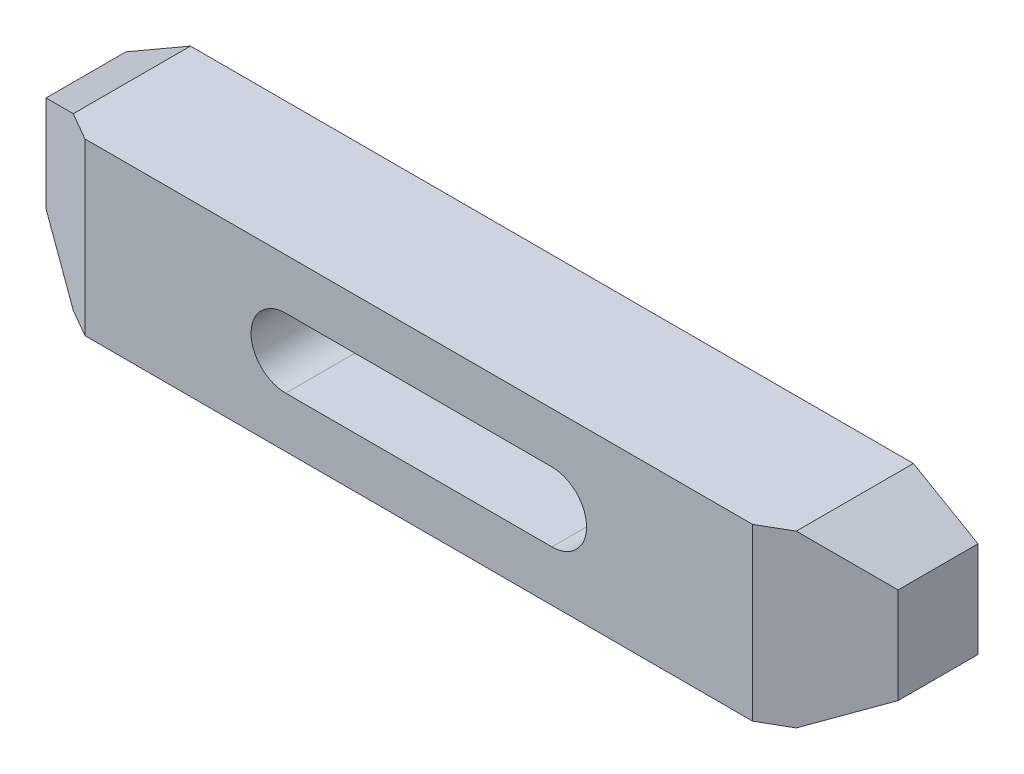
ISO-10303-21;
HEADER;
FILE_DESCRIPTION(('STEP AP214'),'2;1');
FILE_NAME('part.step','',(''),(''),'','','');
FILE_SCHEMA(('AUTOMOTIVE_DESIGN { 1 0 10303 214 1 1 1 1 }'));
ENDSEC;
DATA;
#1=APPLICATION_CONTEXT('core data for automotive mechanical design processes');
#2=APPLICATION_PROTOCOL_DEFINITION('international standard','automotive_design',2000,#1);
#3=PRODUCT_CONTEXT('',#1,'mechanical');
#4=PRODUCT('Part','Part','',(#3));
#5=PRODUCT_RELATED_PRODUCT_CATEGORY('part','',(#4));
#6=PRODUCT_DEFINITION_FORMATION('','',#4);
#7=PRODUCT_DEFINITION_CONTEXT('part definition',#1,'design');
#8=PRODUCT_DEFINITION('design','',#6,#7);
#9=PRODUCT_DEFINITION_SHAPE('','',#8);
#10=(LENGTH_UNIT() NAMED_UNIT(*) SI_UNIT(.MILLI.,.METRE.));
#11=(NAMED_UNIT(*) PLANE_ANGLE_UNIT() SI_UNIT($,.RADIAN.));
#12=(NAMED_UNIT(*) SI_UNIT($,.STERADIAN.) SOLID_ANGLE_UNIT());
#13=UNCERTAINTY_MEASURE_WITH_UNIT(LENGTH_MEASURE(1.E-05),#10,'distance_accuracy_value','');
#14=(GEOMETRIC_REPRESENTATION_CONTEXT(3) GLOBAL_UNCERTAINTY_ASSIGNED_CONTEXT((#13)) GLOBAL_UNIT_ASSIGNED_CONTEXT((#10,
#11,#12)) REPRESENTATION_CONTEXT('',''));
#15=CARTESIAN_POINT('',(0.,0.,0.));
#16=DIRECTION('',(0.,0.,1.));
#17=DIRECTION('',(1.,0.,0.));
#18=AXIS2_PLACEMENT_3D('',#15,#16,#17);
#19=CARTESIAN_POINT('',(0.,-55.1880215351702,25.));
#20=DIRECTION('',(0.,0.,-1.));
#21=DIRECTION('',(-1.,0.,0.));
#22=AXIS2_PLACEMENT_3D('',#19,#20,#21);
#23=PLANE('',#22);
#24=CARTESIAN_POINT('',(25.,0.,25.));
#25=DIRECTION('',(0.,0.,1.));
#26=DIRECTION('',(1.,0.,0.));
#27=AXIS2_PLACEMENT_3D('',#24,#25,#26);
#28=CIRCLE('',#27,6.5);
#29=CARTESIAN_POINT('',(25.,-6.5,25.));
#30=VERTEX_POINT('',#29);
#31=CARTESIAN_POINT('',(25.,6.5,25.));
#32=VERTEX_POINT('',#31);
#33=EDGE_CURVE('E200',#30,#32,#28,.T.);
#34=ORIENTED_EDGE('',*,*,#33,.F.);
#35=DIRECTION('',(-1.,0.,0.));
#36=VECTOR('',#35,1.);
#37=CARTESIAN_POINT('',(25.,-6.5,25.));
#38=LINE('',#37,#36);
#39=CARTESIAN_POINT('',(-25.,-6.5,25.));
#40=VERTEX_POINT('',#39);
#41=EDGE_CURVE('E199',#30,#40,#38,.T.);
#42=ORIENTED_EDGE('',*,*,#41,.T.);
#43=CARTESIAN_POINT('',(-25.,0.,25.));
#44=DIRECTION('',(0.,0.,1.));
#45=DIRECTION('',(1.,0.,0.));
#46=AXIS2_PLACEMENT_3D('',#43,#44,#45);
#47=CIRCLE('',#46,6.5);
#48=CARTESIAN_POINT('',(-25.,6.5,25.));
#49=VERTEX_POINT('',#48);
#50=EDGE_CURVE('E207',#49,#40,#47,.T.);
#51=ORIENTED_EDGE('',*,*,#50,.F.);
#52=DIRECTION('',(-1.,0.,0.));
#53=VECTOR('',#52,1.);
#54=CARTESIAN_POINT('',(25.,6.5,25.));
#55=LINE('',#54,#53);
#56=EDGE_CURVE('E203',#32,#49,#55,.T.);
#57=ORIENTED_EDGE('',*,*,#56,.F.);
#58=EDGE_LOOP('',(#34,#42,#51,#57));
#59=FACE_BOUND('',#58,.T.);
#60=DIRECTION('',(0.,1.,0.));
#61=VECTOR('',#60,1.);
#62=CARTESIAN_POINT('',(-62.679491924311,-55.1880215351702,25.));
#63=LINE('',#62,#61);
#64=CARTESIAN_POINT('',(-62.679491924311,-16.,25.));
#65=VERTEX_POINT('',#64);
#66=CARTESIAN_POINT('',(-62.679491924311,16.,25.));
#67=VERTEX_POINT('',#66);
#68=EDGE_CURVE('E128',#65,#67,#63,.T.);
#69=ORIENTED_EDGE('',*,*,#68,.F.);
#70=DIRECTION('',(-1.,0.,0.));
#71=VECTOR('',#70,1.);
#72=CARTESIAN_POINT('',(67.8756443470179,-16.,25.));
#73=LINE('',#72,#71);
#74=CARTESIAN_POINT('',(62.6794919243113,-16.,25.));
#75=VERTEX_POINT('',#74);
#76=EDGE_CURVE('E168',#75,#65,#73,.T.);
#77=ORIENTED_EDGE('',*,*,#76,.F.);
#78=DIRECTION('',(0.,1.,0.));
#79=VECTOR('',#78,1.);
#80=CARTESIAN_POINT('',(62.6794919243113,-55.1880215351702,25.));
#81=LINE('',#80,#79);
#82=CARTESIAN_POINT('',(62.6794919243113,16.,25.));
#83=VERTEX_POINT('',#82);
#84=EDGE_CURVE('E36',#75,#83,#81,.T.);
#85=ORIENTED_EDGE('',*,*,#84,.T.);
#86=DIRECTION('',(1.,0.,0.));
#87=VECTOR('',#86,1.);
#88=CARTESIAN_POINT('',(-67.8756443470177,16.,25.));
#89=LINE('',#88,#87);
#90=EDGE_CURVE('E167',#67,#83,#89,.T.);
#91=ORIENTED_EDGE('',*,*,#90,.F.);
#92=EDGE_LOOP('',(#69,#77,#85,#91));
#93=FACE_BOUND('',#92,.T.);
#94=ADVANCED_FACE('F14',(#59,#93),#23,.F.);
#95=CARTESIAN_POINT('',(-67.8756443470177,16.,25.));
#96=DIRECTION('',(0.,1.,0.));
#97=DIRECTION('',(0.,0.,1.));
#98=AXIS2_PLACEMENT_3D('',#95,#96,#97);
#99=PLANE('',#98);
#100=DIRECTION('',(0.,0.,-1.));
#101=VECTOR('',#100,1.);
#102=CARTESIAN_POINT('',(-67.8756443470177,16.,25.));
#103=LINE('',#102,#101);
#104=CARTESIAN_POINT('',(-67.8756443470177,16.,22.));
#105=VERTEX_POINT('',#104);
#106=CARTESIAN_POINT('',(-67.8756443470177,16.,0.));
#107=VERTEX_POINT('',#106);
#108=EDGE_CURVE('E136',#105,#107,#103,.T.);
#109=ORIENTED_EDGE('',*,*,#108,.F.);
#110=DIRECTION('',(0.866025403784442,0.,0.5));
#111=VECTOR('',#110,1.);
#112=CARTESIAN_POINT('',(-66.576606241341,16.,22.75));
#113=LINE('',#112,#111);
#114=EDGE_CURVE('E229',#105,#67,#113,.T.);
#115=ORIENTED_EDGE('',*,*,#114,.T.);
#116=ORIENTED_EDGE('',*,*,#90,.T.);
#117=DIRECTION('',(-0.866025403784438,0.,0.5));
#118=VECTOR('',#117,1.);
#119=CARTESIAN_POINT('',(-35.2368602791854,16.,81.5320323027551));
#120=LINE('',#119,#118);
#121=CARTESIAN_POINT('',(67.8756443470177,16.,22.));
#122=VERTEX_POINT('',#121);
#123=EDGE_CURVE('E224',#122,#83,#120,.T.);
#124=ORIENTED_EDGE('',*,*,#123,.F.);
#125=DIRECTION('',(0.,0.,-1.));
#126=VECTOR('',#125,1.);
#127=CARTESIAN_POINT('',(67.8756443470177,16.,25.));
#128=LINE('',#127,#126);
#129=CARTESIAN_POINT('',(67.8756443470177,16.,0.));
#130=VERTEX_POINT('',#129);
#131=EDGE_CURVE('E143',#122,#130,#128,.T.);
#132=ORIENTED_EDGE('',*,*,#131,.T.);
#133=DIRECTION('',(1.,0.,0.));
#134=VECTOR('',#133,1.);
#135=CARTESIAN_POINT('',(-67.8756443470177,16.,0.));
#136=LINE('',#135,#134);
#137=EDGE_CURVE('E183',#107,#130,#136,.T.);
#138=ORIENTED_EDGE('',*,*,#137,.F.);
#139=EDGE_LOOP('',(#109,#115,#116,#124,#132,#138));
#140=FACE_BOUND('',#139,.T.);
#141=ADVANCED_FACE('F237',(#140),#99,.T.);
#142=CARTESIAN_POINT('',(-80.,9.,25.));
#143=DIRECTION('',(-0.5,0.866025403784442,0.));
#144=DIRECTION('',(-0.866025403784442,-0.5,0.));
#145=AXIS2_PLACEMENT_3D('',#142,#143,#144);
#146=PLANE('',#145);
#147=DIRECTION('',(0.,0.,-1.));
#148=VECTOR('',#147,1.);
#149=CARTESIAN_POINT('',(-80.,9.,25.));
#150=LINE('',#149,#148);
#151=CARTESIAN_POINT('',(-80.,9.,15.));
#152=VERTEX_POINT('',#151);
#153=CARTESIAN_POINT('',(-80.,9.,0.));
#154=VERTEX_POINT('',#153);
#155=EDGE_CURVE('E134',#152,#154,#150,.T.);
#156=ORIENTED_EDGE('',*,*,#155,.F.);
#157=DIRECTION('',(0.774596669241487,0.447213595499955,0.447213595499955));
#158=VECTOR('',#157,1.);
#159=CARTESIAN_POINT('',(-76.5358983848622,11.,17.));
#160=LINE('',#159,#158);
#161=EDGE_CURVE('E116',#152,#105,#160,.T.);
#162=ORIENTED_EDGE('',*,*,#161,.T.);
#163=ORIENTED_EDGE('',*,*,#108,.T.);
#164=DIRECTION('',(0.866025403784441,0.5,0.));
#165=VECTOR('',#164,1.);
#166=CARTESIAN_POINT('',(-80.,9.,0.));
#167=LINE('',#166,#165);
#168=EDGE_CURVE('E180',#154,#107,#167,.T.);
#169=ORIENTED_EDGE('',*,*,#168,.F.);
#170=EDGE_LOOP('',(#156,#162,#163,#169));
#171=FACE_BOUND('',#170,.T.);
#172=ADVANCED_FACE('F253',(#171),#146,.T.);
#173=CARTESIAN_POINT('',(-80.,-9.,25.));
#174=DIRECTION('',(-1.,0.,0.));
#175=DIRECTION('',(0.,0.,1.));
#176=AXIS2_PLACEMENT_3D('',#173,#174,#175);
#177=PLANE('',#176);
#178=DIRECTION('',(0.,0.,-1.));
#179=VECTOR('',#178,1.);
#180=CARTESIAN_POINT('',(-80.,-9.,25.));
#181=LINE('',#180,#179);
#182=CARTESIAN_POINT('',(-80.,-9.,15.));
#183=VERTEX_POINT('',#182);
#184=CARTESIAN_POINT('',(-80.,-9.,0.));
#185=VERTEX_POINT('',#184);
#186=EDGE_CURVE('E125',#183,#185,#181,.T.);
#187=ORIENTED_EDGE('',*,*,#186,.F.);
#188=DIRECTION('',(0.,1.,0.));
#189=VECTOR('',#188,1.);
#190=CARTESIAN_POINT('',(-80.,-20.,15.));
#191=LINE('',#190,#189);
#192=EDGE_CURVE('E113',#183,#152,#191,.T.);
#193=ORIENTED_EDGE('',*,*,#192,.T.);
#194=ORIENTED_EDGE('',*,*,#155,.T.);
#195=DIRECTION('',(0.,1.,0.));
#196=VECTOR('',#195,1.);
#197=CARTESIAN_POINT('',(-80.,-9.,0.));
#198=LINE('',#197,#196);
#199=EDGE_CURVE('E133',#185,#154,#198,.T.);
#200=ORIENTED_EDGE('',*,*,#199,.F.);
#201=EDGE_LOOP('',(#187,#193,#194,#200));
#202=FACE_BOUND('',#201,.T.);
#203=ADVANCED_FACE('F131',(#202),#177,.T.);
#204=CARTESIAN_POINT('',(-67.8756443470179,-16.,25.));
#205=DIRECTION('',(-0.5,-0.866025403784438,0.));
#206=DIRECTION('',(0.866025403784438,-0.5,0.));
#207=AXIS2_PLACEMENT_3D('',#204,#205,#206);
#208=PLANE('',#207);
#209=DIRECTION('',(0.,0.,-1.));
#210=VECTOR('',#209,1.);
#211=CARTESIAN_POINT('',(-67.8756443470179,-16.,25.));
#212=LINE('',#211,#210);
#213=CARTESIAN_POINT('',(-67.8756443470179,-16.,22.));
#214=VERTEX_POINT('',#213);
#215=CARTESIAN_POINT('',(-67.8756443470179,-16.,0.));
#216=VERTEX_POINT('',#215);
#217=EDGE_CURVE('E127',#214,#216,#212,.T.);
#218=ORIENTED_EDGE('',*,*,#217,.F.);
#219=DIRECTION('',(-0.774596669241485,0.44721359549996,-0.447213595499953));
#220=VECTOR('',#219,1.);
#221=CARTESIAN_POINT('',(-66.8364138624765,-16.6,22.6));
#222=LINE('',#221,#220);
#223=EDGE_CURVE('E29',#214,#183,#222,.T.);
#224=ORIENTED_EDGE('',*,*,#223,.T.);
#225=ORIENTED_EDGE('',*,*,#186,.T.);
#226=DIRECTION('',(-0.866025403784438,0.5,0.));
#227=VECTOR('',#226,1.);
#228=CARTESIAN_POINT('',(-67.8756443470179,-16.,0.));
#229=LINE('',#228,#227);
#230=EDGE_CURVE('E177',#216,#185,#229,.T.);
#231=ORIENTED_EDGE('',*,*,#230,.F.);
#232=EDGE_LOOP('',(#218,#224,#225,#231));
#233=FACE_BOUND('',#232,.T.);
#234=ADVANCED_FACE('F123',(#233),#208,.T.);
#235=CARTESIAN_POINT('',(67.8756443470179,-16.,25.));
#236=DIRECTION('',(0.,-1.,0.));
#237=DIRECTION('',(1.,0.,0.));
#238=AXIS2_PLACEMENT_3D('',#235,#236,#237);
#239=PLANE('',#238);
#240=ORIENTED_EDGE('',*,*,#76,.T.);
#241=DIRECTION('',(-0.866025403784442,0.,-0.5));
#242=VECTOR('',#241,1.);
#243=CARTESIAN_POINT('',(35.2368602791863,-16.,81.5320323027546));
#244=LINE('',#243,#242);
#245=EDGE_CURVE('E9',#65,#214,#244,.T.);
#246=ORIENTED_EDGE('',*,*,#245,.T.);
#247=ORIENTED_EDGE('',*,*,#217,.T.);
#248=DIRECTION('',(-1.,0.,0.));
#249=VECTOR('',#248,1.);
#250=CARTESIAN_POINT('',(67.8756443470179,-16.,0.));
#251=LINE('',#250,#249);
#252=CARTESIAN_POINT('',(67.8756443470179,-16.,0.));
#253=VERTEX_POINT('',#252);
#254=EDGE_CURVE('E166',#253,#216,#251,.T.);
#255=ORIENTED_EDGE('',*,*,#254,.F.);
#256=DIRECTION('',(0.,0.,-1.));
#257=VECTOR('',#256,1.);
#258=CARTESIAN_POINT('',(67.8756443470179,-16.,25.));
#259=LINE('',#258,#257);
#260=CARTESIAN_POINT('',(67.8756443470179,-16.,22.));
#261=VERTEX_POINT('',#260);
#262=EDGE_CURVE('E138',#261,#253,#259,.T.);
#263=ORIENTED_EDGE('',*,*,#262,.F.);
#264=DIRECTION('',(0.866025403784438,0.,-0.5));
#265=VECTOR('',#264,1.);
#266=CARTESIAN_POINT('',(66.5766062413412,-16.,22.75));
#267=LINE('',#266,#265);
#268=EDGE_CURVE('E22',#75,#261,#267,.T.);
#269=ORIENTED_EDGE('',*,*,#268,.F.);
#270=EDGE_LOOP('',(#240,#246,#247,#255,#263,#269));
#271=FACE_BOUND('',#270,.T.);
#272=ADVANCED_FACE('F164',(#271),#239,.T.);
#273=CARTESIAN_POINT('',(0.,-55.1880215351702,0.));
#274=DIRECTION('',(0.,0.,-1.));
#275=DIRECTION('',(-1.,0.,0.));
#276=AXIS2_PLACEMENT_3D('',#273,#274,#275);
#277=PLANE('',#276);
#278=DIRECTION('',(-0.866025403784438,-0.5,0.));
#279=VECTOR('',#278,1.);
#280=CARTESIAN_POINT('',(80.,-9.,0.));
#281=LINE('',#280,#279);
#282=CARTESIAN_POINT('',(80.,-9.,0.));
#283=VERTEX_POINT('',#282);
#284=EDGE_CURVE('E173',#283,#253,#281,.T.);
#285=ORIENTED_EDGE('',*,*,#284,.T.);
#286=ORIENTED_EDGE('',*,*,#254,.T.);
#287=ORIENTED_EDGE('',*,*,#230,.T.);
#288=ORIENTED_EDGE('',*,*,#199,.T.);
#289=ORIENTED_EDGE('',*,*,#168,.T.);
#290=ORIENTED_EDGE('',*,*,#137,.T.);
#291=DIRECTION('',(0.866025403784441,-0.5,0.));
#292=VECTOR('',#291,1.);
#293=CARTESIAN_POINT('',(67.8756443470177,16.,0.));
#294=LINE('',#293,#292);
#295=CARTESIAN_POINT('',(80.,9.,0.));
#296=VERTEX_POINT('',#295);
#297=EDGE_CURVE('E186',#130,#296,#294,.T.);
#298=ORIENTED_EDGE('',*,*,#297,.T.);
#299=DIRECTION('',(0.,-1.,0.));
#300=VECTOR('',#299,1.);
#301=CARTESIAN_POINT('',(80.,9.,0.));
#302=LINE('',#301,#300);
#303=EDGE_CURVE('E171',#296,#283,#302,.T.);
#304=ORIENTED_EDGE('',*,*,#303,.T.);
#305=EDGE_LOOP('',(#285,#286,#287,#288,#289,#290,#298,#304));
#306=FACE_BOUND('',#305,.T.);
#307=DIRECTION('',(-1.,0.,0.));
#308=VECTOR('',#307,1.);
#309=CARTESIAN_POINT('',(25.,-6.5,0.));
#310=LINE('',#309,#308);
#311=CARTESIAN_POINT('',(25.,-6.5,0.));
#312=VERTEX_POINT('',#311);
#313=CARTESIAN_POINT('',(-25.,-6.5,0.));
#314=VERTEX_POINT('',#313);
#315=EDGE_CURVE('E204',#312,#314,#310,.T.);
#316=ORIENTED_EDGE('',*,*,#315,.F.);
#317=CARTESIAN_POINT('',(25.,0.,0.));
#318=DIRECTION('',(0.,0.,1.));
#319=DIRECTION('',(1.,0.,0.));
#320=AXIS2_PLACEMENT_3D('',#317,#318,#319);
#321=CIRCLE('',#320,6.5);
#322=CARTESIAN_POINT('',(25.,6.5,0.));
#323=VERTEX_POINT('',#322);
#324=EDGE_CURVE('E211',#312,#323,#321,.T.);
#325=ORIENTED_EDGE('',*,*,#324,.T.);
#326=DIRECTION('',(-1.,0.,0.));
#327=VECTOR('',#326,1.);
#328=CARTESIAN_POINT('',(25.,6.5,0.));
#329=LINE('',#328,#327);
#330=CARTESIAN_POINT('',(-25.,6.5,0.));
#331=VERTEX_POINT('',#330);
#332=EDGE_CURVE('E214',#323,#331,#329,.T.);
#333=ORIENTED_EDGE('',*,*,#332,.T.);
#334=CARTESIAN_POINT('',(-25.,0.,0.));
#335=DIRECTION('',(0.,0.,1.));
#336=DIRECTION('',(1.,0.,0.));
#337=AXIS2_PLACEMENT_3D('',#334,#335,#336);
#338=CIRCLE('',#337,6.5);
#339=EDGE_CURVE('E218',#331,#314,#338,.T.);
#340=ORIENTED_EDGE('',*,*,#339,.T.);
#341=EDGE_LOOP('',(#316,#325,#333,#340));
#342=FACE_BOUND('',#341,.T.);
#343=ADVANCED_FACE('F241',(#306,#342),#277,.T.);
#344=CARTESIAN_POINT('',(80.,-9.,25.));
#345=DIRECTION('',(0.5,-0.866025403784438,0.));
#346=DIRECTION('',(0.866025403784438,0.5,0.));
#347=AXIS2_PLACEMENT_3D('',#344,#345,#346);
#348=PLANE('',#347);
#349=DIRECTION('',(0.774596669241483,0.447213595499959,-0.447213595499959));
#350=VECTOR('',#349,1.);
#351=CARTESIAN_POINT('',(76.5358983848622,-11.,17.));
#352=LINE('',#351,#350);
#353=CARTESIAN_POINT('',(80.,-9.,15.));
#354=VERTEX_POINT('',#353);
#355=EDGE_CURVE('E150',#261,#354,#352,.T.);
#356=ORIENTED_EDGE('',*,*,#355,.F.);
#357=ORIENTED_EDGE('',*,*,#262,.T.);
#358=ORIENTED_EDGE('',*,*,#284,.F.);
#359=DIRECTION('',(0.,0.,-1.));
#360=VECTOR('',#359,1.);
#361=CARTESIAN_POINT('',(80.,-9.,25.));
#362=LINE('',#361,#360);
#363=EDGE_CURVE('E147',#354,#283,#362,.T.);
#364=ORIENTED_EDGE('',*,*,#363,.F.);
#365=EDGE_LOOP('',(#356,#357,#358,#364));
#366=FACE_BOUND('',#365,.T.);
#367=ADVANCED_FACE('F158',(#366),#348,.T.);
#368=CARTESIAN_POINT('',(80.,9.,25.));
#369=DIRECTION('',(1.,0.,0.));
#370=DIRECTION('',(0.,0.,-1.));
#371=AXIS2_PLACEMENT_3D('',#368,#369,#370);
#372=PLANE('',#371);
#373=DIRECTION('',(0.,1.,0.));
#374=VECTOR('',#373,1.);
#375=CARTESIAN_POINT('',(80.,-20.,15.));
#376=LINE('',#375,#374);
#377=CARTESIAN_POINT('',(80.,9.,15.));
#378=VERTEX_POINT('',#377);
#379=EDGE_CURVE('E161',#354,#378,#376,.T.);
#380=ORIENTED_EDGE('',*,*,#379,.F.);
#381=ORIENTED_EDGE('',*,*,#363,.T.);
#382=ORIENTED_EDGE('',*,*,#303,.F.);
#383=DIRECTION('',(0.,0.,-1.));
#384=VECTOR('',#383,1.);
#385=CARTESIAN_POINT('',(80.,9.,25.));
#386=LINE('',#385,#384);
#387=EDGE_CURVE('E145',#378,#296,#386,.T.);
#388=ORIENTED_EDGE('',*,*,#387,.F.);
#389=EDGE_LOOP('',(#380,#381,#382,#388));
#390=FACE_BOUND('',#389,.T.);
#391=ADVANCED_FACE('F16',(#390),#372,.T.);
#392=CARTESIAN_POINT('',(67.8756443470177,16.,25.));
#393=DIRECTION('',(0.5,0.866025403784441,0.));
#394=DIRECTION('',(-0.866025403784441,0.5,0.));
#395=AXIS2_PLACEMENT_3D('',#392,#393,#394);
#396=PLANE('',#395);
#397=DIRECTION('',(-0.774596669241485,0.447213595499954,0.44721359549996));
#398=VECTOR('',#397,1.);
#399=CARTESIAN_POINT('',(66.8364138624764,16.6,22.6));
#400=LINE('',#399,#398);
#401=EDGE_CURVE('E215',#378,#122,#400,.T.);
#402=ORIENTED_EDGE('',*,*,#401,.F.);
#403=ORIENTED_EDGE('',*,*,#387,.T.);
#404=ORIENTED_EDGE('',*,*,#297,.F.);
#405=ORIENTED_EDGE('',*,*,#131,.F.);
#406=EDGE_LOOP('',(#402,#403,#404,#405));
#407=FACE_BOUND('',#406,.T.);
#408=ADVANCED_FACE('F250',(#407),#396,.T.);
#409=CARTESIAN_POINT('',(25.,0.,25.));
#410=DIRECTION('',(0.,0.,-1.));
#411=DIRECTION('',(-1.,0.,0.));
#412=AXIS2_PLACEMENT_3D('',#409,#410,#411);
#413=CYLINDRICAL_SURFACE('',#412,6.5);
#414=DIRECTION('',(0.,0.,-1.));
#415=VECTOR('',#414,1.);
#416=CARTESIAN_POINT('',(25.,6.5,25.));
#417=LINE('',#416,#415);
#418=EDGE_CURVE('E175',#32,#323,#417,.T.);
#419=ORIENTED_EDGE('',*,*,#418,.T.);
#420=ORIENTED_EDGE('',*,*,#324,.F.);
#421=DIRECTION('',(0.,0.,-1.));
#422=VECTOR('',#421,1.);
#423=CARTESIAN_POINT('',(25.,-6.5,25.));
#424=LINE('',#423,#422);
#425=EDGE_CURVE('E196',#30,#312,#424,.T.);
#426=ORIENTED_EDGE('',*,*,#425,.F.);
#427=ORIENTED_EDGE('',*,*,#33,.T.);
#428=EDGE_LOOP('',(#419,#420,#426,#427));
#429=FACE_BOUND('',#428,.T.);
#430=ADVANCED_FACE('F312',(#429),#413,.F.);
#431=CARTESIAN_POINT('',(25.,6.5,25.));
#432=DIRECTION('',(0.,-1.,0.));
#433=DIRECTION('',(1.,0.,0.));
#434=AXIS2_PLACEMENT_3D('',#431,#432,#433);
#435=PLANE('',#434);
#436=DIRECTION('',(0.,0.,-1.));
#437=VECTOR('',#436,1.);
#438=CARTESIAN_POINT('',(-25.,6.5,25.));
#439=LINE('',#438,#437);
#440=EDGE_CURVE('E192',#49,#331,#439,.T.);
#441=ORIENTED_EDGE('',*,*,#440,.T.);
#442=ORIENTED_EDGE('',*,*,#332,.F.);
#443=ORIENTED_EDGE('',*,*,#418,.F.);
#444=ORIENTED_EDGE('',*,*,#56,.T.);
#445=EDGE_LOOP('',(#441,#442,#443,#444));
#446=FACE_BOUND('',#445,.T.);
#447=ADVANCED_FACE('F319',(#446),#435,.T.);
#448=CARTESIAN_POINT('',(-25.,0.,25.));
#449=DIRECTION('',(0.,0.,-1.));
#450=DIRECTION('',(-1.,0.,0.));
#451=AXIS2_PLACEMENT_3D('',#448,#449,#450);
#452=CYLINDRICAL_SURFACE('',#451,6.5);
#453=DIRECTION('',(0.,0.,-1.));
#454=VECTOR('',#453,1.);
#455=CARTESIAN_POINT('',(-25.,-6.5,25.));
#456=LINE('',#455,#454);
#457=EDGE_CURVE('E194',#40,#314,#456,.T.);
#458=ORIENTED_EDGE('',*,*,#457,.T.);
#459=ORIENTED_EDGE('',*,*,#339,.F.);
#460=ORIENTED_EDGE('',*,*,#440,.F.);
#461=ORIENTED_EDGE('',*,*,#50,.T.);
#462=EDGE_LOOP('',(#458,#459,#460,#461));
#463=FACE_BOUND('',#462,.T.);
#464=ADVANCED_FACE('F328',(#463),#452,.F.);
#465=CARTESIAN_POINT('',(25.,-6.5,25.));
#466=DIRECTION('',(0.,-1.,0.));
#467=DIRECTION('',(1.,0.,0.));
#468=AXIS2_PLACEMENT_3D('',#465,#466,#467);
#469=PLANE('',#468);
#470=ORIENTED_EDGE('',*,*,#41,.F.);
#471=ORIENTED_EDGE('',*,*,#425,.T.);
#472=ORIENTED_EDGE('',*,*,#315,.T.);
#473=ORIENTED_EDGE('',*,*,#457,.F.);
#474=EDGE_LOOP('',(#470,#471,#472,#473));
#475=FACE_BOUND('',#474,.T.);
#476=ADVANCED_FACE('F336',(#475),#469,.F.);
#477=CARTESIAN_POINT('',(80.,-20.,15.));
#478=DIRECTION('',(-0.5,0.,-0.866025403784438));
#479=DIRECTION('',(-0.866025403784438,0.,0.5));
#480=AXIS2_PLACEMENT_3D('',#477,#478,#479);
#481=PLANE('',#480);
#482=ORIENTED_EDGE('',*,*,#401,.T.);
#483=ORIENTED_EDGE('',*,*,#123,.T.);
#484=ORIENTED_EDGE('',*,*,#84,.F.);
#485=ORIENTED_EDGE('',*,*,#268,.T.);
#486=ORIENTED_EDGE('',*,*,#355,.T.);
#487=ORIENTED_EDGE('',*,*,#379,.T.);
#488=EDGE_LOOP('',(#482,#483,#484,#485,#486,#487));
#489=FACE_BOUND('',#488,.T.);
#490=ADVANCED_FACE('F149',(#489),#481,.F.);
#491=CARTESIAN_POINT('',(-80.,-20.,15.));
#492=DIRECTION('',(-0.5,0.,0.866025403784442));
#493=DIRECTION('',(0.866025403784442,0.,0.5));
#494=AXIS2_PLACEMENT_3D('',#491,#492,#493);
#495=PLANE('',#494);
#496=ORIENTED_EDGE('',*,*,#192,.F.);
#497=ORIENTED_EDGE('',*,*,#223,.F.);
#498=ORIENTED_EDGE('',*,*,#245,.F.);
#499=ORIENTED_EDGE('',*,*,#68,.T.);
#500=ORIENTED_EDGE('',*,*,#114,.F.);
#501=ORIENTED_EDGE('',*,*,#161,.F.);
#502=EDGE_LOOP('',(#496,#497,#498,#499,#500,#501));
#503=FACE_BOUND('',#502,.T.);
#504=ADVANCED_FACE('F114',(#503),#495,.T.);
#505=CLOSED_SHELL('',(#94,#141,#172,#203,#234,#272,#343,#367,#391,#408,#430,#447,#464,#476,#490,#504));
#506=MANIFOLD_SOLID_BREP('B1',#505);
#507=ADVANCED_BREP_SHAPE_REPRESENTATION('',(#18,#506),#14);
#508=SHAPE_DEFINITION_REPRESENTATION(#9,#507);
ENDSEC;
END-ISO-10303-21;
